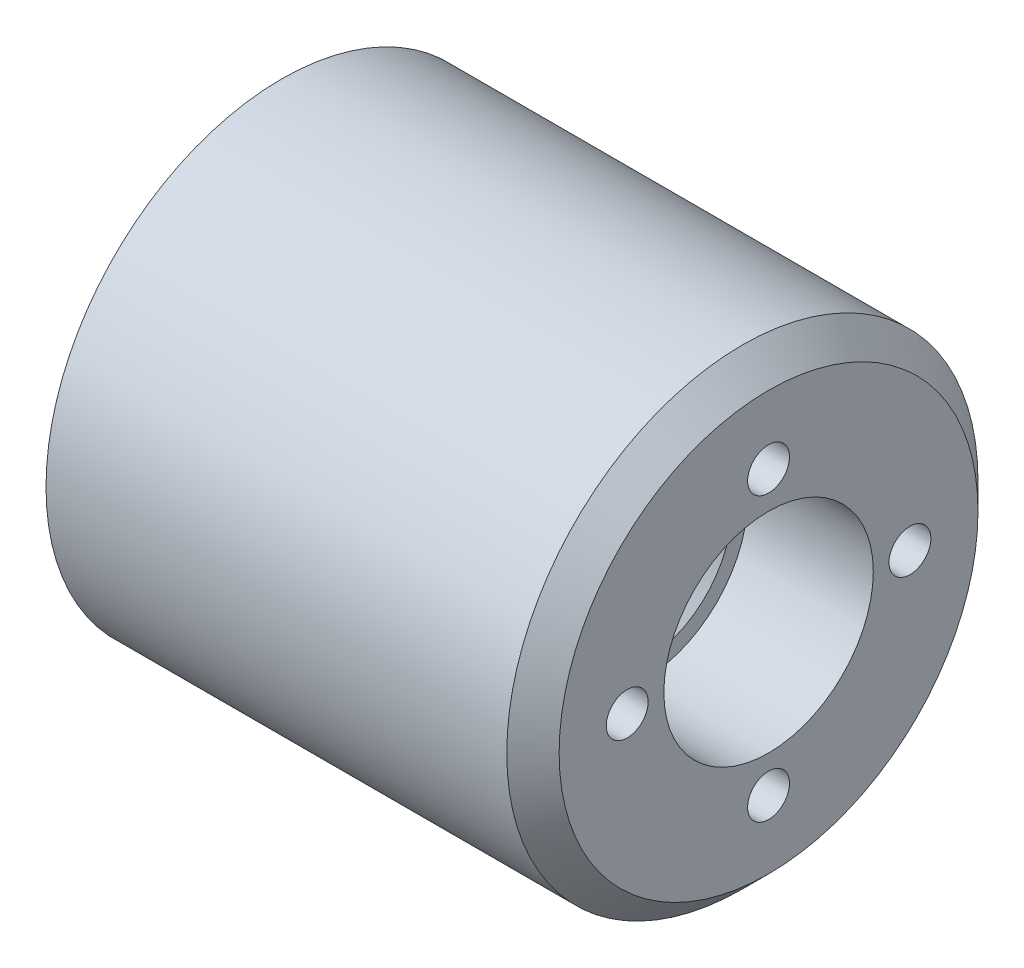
from build123d import *

# Parameters (mm, degrees)
CHANFREIN1_SIZE              = 5
CHANFREIN2_SIZE              = 4
ESQUISSE2_R                  = 4
ENL_V_MAT_EXTRU_1_DEPTH      = 15
R_P_TITION_CIRCULAIRE1_COUNT = 6
ESQUISSE3_R                  = 4
ENL_V_MAT_EXTRU_2_DEPTH      = 15
R_P_TITION_CIRCULAIRE2_COUNT = 4


with BuildPart() as part:
    # Esquisse1 → R_volution1 (revolve)
    with BuildSketch(Plane.XY, mode=Mode.PRIVATE) as r_volution1_sk:
        Polygon((0, 31), (0, 45), (93, 45), (93, 20), (69, 20), (69, 13), (61, 13), (61, 27), (48, 27), (48, 31), align=None)
    revolve(r_volution1_sk.sketch.rotate(Axis((0, 0, 0), (1, 0, 0)), 90), axis=Axis((0, 0, 0), (1, 0, 0)))

    # Chanfrein1
    chanfrein1_edges = [part.edges().sort_by_distance(p)[0] for p in [
        (93, 0, -45),
    ]]
    chamfer(chanfrein1_edges, length=CHANFREIN1_SIZE)

    # Chanfrein2
    chanfrein2_edges = [part.edges().sort_by_distance(p)[0] for p in [
        (69, 0, -13),
    ]]
    chamfer(chanfrein2_edges, length=CHANFREIN2_SIZE)

    # Esquisse2 → Enl_v. mat.-Extru.1 (cut)
    with BuildSketch(Plane.ZY):
        with Locations((0, 37.5)):
            Circle(ESQUISSE2_R)
    enl_v_mat_extru_1 = extrude(amount=-ENL_V_MAT_EXTRU_1_DEPTH, mode=Mode.SUBTRACT)

    # R_p_tition circulaire1: Enl_v. mat.-Extru.1 ×6 about axis
    r_p_tition_circulaire1_axis = Axis((0, 0, 0), (1, 0, 0))
    for i in range(1, R_P_TITION_CIRCULAIRE1_COUNT):
        add(enl_v_mat_extru_1.rotate(r_p_tition_circulaire1_axis, i * 360 / R_P_TITION_CIRCULAIRE1_COUNT), mode=Mode.SUBTRACT)

    # Esquisse3 → Enl_v. mat.-Extru.2 (cut)
    with BuildSketch(Plane(origin=(93, 0, 0), x_dir=(0, 0, -1), z_dir=(1, 0, 0))):
        with Locations((0, 27)):
            Circle(ESQUISSE3_R)
    enl_v_mat_extru_2 = extrude(amount=-ENL_V_MAT_EXTRU_2_DEPTH, mode=Mode.SUBTRACT)

    # R_p_tition circulaire2: Enl_v. mat.-Extru.2 ×4 about axis
    r_p_tition_circulaire2_axis = Axis((0, 0, 0), (1, 0, 0))
    for i in range(1, R_P_TITION_CIRCULAIRE2_COUNT):
        add(enl_v_mat_extru_2.rotate(r_p_tition_circulaire2_axis, i * 360 / R_P_TITION_CIRCULAIRE2_COUNT), mode=Mode.SUBTRACT)


solid = part.part
